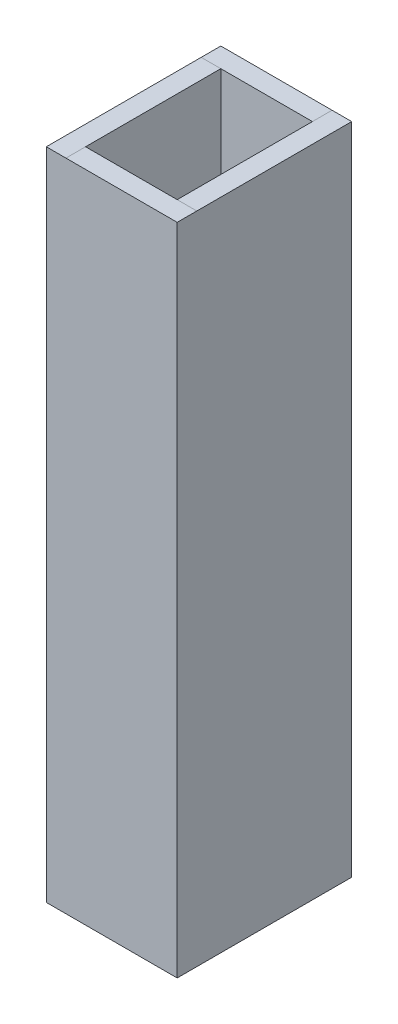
ISO-10303-21;
HEADER;
FILE_DESCRIPTION(('STEP AP214'),'2;1');
FILE_NAME('part.step','',(''),(''),'','','');
FILE_SCHEMA(('AUTOMOTIVE_DESIGN { 1 0 10303 214 1 1 1 1 }'));
ENDSEC;
DATA;
#1=APPLICATION_CONTEXT('core data for automotive mechanical design processes');
#2=APPLICATION_PROTOCOL_DEFINITION('international standard','automotive_design',2000,#1);
#3=PRODUCT_CONTEXT('',#1,'mechanical');
#4=PRODUCT('Part','Part','',(#3));
#5=PRODUCT_RELATED_PRODUCT_CATEGORY('part','',(#4));
#6=PRODUCT_DEFINITION_FORMATION('','',#4);
#7=PRODUCT_DEFINITION_CONTEXT('part definition',#1,'design');
#8=PRODUCT_DEFINITION('design','',#6,#7);
#9=PRODUCT_DEFINITION_SHAPE('','',#8);
#10=(LENGTH_UNIT() NAMED_UNIT(*) SI_UNIT(.MILLI.,.METRE.));
#11=(NAMED_UNIT(*) PLANE_ANGLE_UNIT() SI_UNIT($,.RADIAN.));
#12=(NAMED_UNIT(*) SI_UNIT($,.STERADIAN.) SOLID_ANGLE_UNIT());
#13=UNCERTAINTY_MEASURE_WITH_UNIT(LENGTH_MEASURE(1.E-05),#10,'distance_accuracy_value','');
#14=(GEOMETRIC_REPRESENTATION_CONTEXT(3) GLOBAL_UNCERTAINTY_ASSIGNED_CONTEXT((#13)) GLOBAL_UNIT_ASSIGNED_CONTEXT((#10,
#11,#12)) REPRESENTATION_CONTEXT('',''));
#15=CARTESIAN_POINT('',(0.,0.,0.));
#16=DIRECTION('',(0.,0.,1.));
#17=DIRECTION('',(1.,0.,0.));
#18=AXIS2_PLACEMENT_3D('',#15,#16,#17);
#19=CARTESIAN_POINT('',(0.,381.,0.));
#20=DIRECTION('',(0.,1.,0.));
#21=DIRECTION('',(0.,0.,1.));
#22=AXIS2_PLACEMENT_3D('',#19,#20,#21);
#23=PLANE('',#22);
#24=DIRECTION('',(0.,0.,-1.));
#25=VECTOR('',#24,1.);
#26=CARTESIAN_POINT('',(-11.43,381.,-11.43));
#27=LINE('',#26,#25);
#28=CARTESIAN_POINT('',(-11.43,381.,-11.43));
#29=VERTEX_POINT('',#28);
#30=CARTESIAN_POINT('',(-11.43,381.,-90.17));
#31=VERTEX_POINT('',#30);
#32=EDGE_CURVE('E114',#29,#31,#27,.T.);
#33=ORIENTED_EDGE('',*,*,#32,.F.);
#34=DIRECTION('',(1.,0.,0.));
#35=VECTOR('',#34,1.);
#36=CARTESIAN_POINT('',(0.,381.,-11.43));
#37=LINE('',#36,#35);
#38=CARTESIAN_POINT('',(0.,381.,-11.43));
#39=VERTEX_POINT('',#38);
#40=EDGE_CURVE('E11',#29,#39,#37,.T.);
#41=ORIENTED_EDGE('',*,*,#40,.T.);
#42=DIRECTION('',(0.,0.,-1.));
#43=VECTOR('',#42,1.);
#44=CARTESIAN_POINT('',(0.,381.,0.));
#45=LINE('',#44,#43);
#46=CARTESIAN_POINT('',(0.,381.,-101.6));
#47=VERTEX_POINT('',#46);
#48=EDGE_CURVE('E175',#39,#47,#45,.T.);
#49=ORIENTED_EDGE('',*,*,#48,.T.);
#50=DIRECTION('',(-1.,0.,0.));
#51=VECTOR('',#50,1.);
#52=CARTESIAN_POINT('',(0.,381.,-101.6));
#53=LINE('',#52,#51);
#54=CARTESIAN_POINT('',(-11.43,381.,-101.6));
#55=VERTEX_POINT('',#54);
#56=EDGE_CURVE('E116',#47,#55,#53,.T.);
#57=ORIENTED_EDGE('',*,*,#56,.T.);
#58=DIRECTION('',(0.,0.,1.));
#59=VECTOR('',#58,1.);
#60=CARTESIAN_POINT('',(-11.43,381.,0.));
#61=LINE('',#60,#59);
#62=EDGE_CURVE('E111',#55,#31,#61,.T.);
#63=ORIENTED_EDGE('',*,*,#62,.T.);
#64=EDGE_LOOP('',(#33,#41,#49,#57,#63));
#65=FACE_BOUND('',#64,.T.);
#66=ADVANCED_FACE('F38',(#65),#23,.T.);
#67=ORIENTED_EDGE('',*,*,#40,.F.);
#68=DIRECTION('',(1.,0.,0.));
#69=VECTOR('',#68,1.);
#70=CARTESIAN_POINT('',(-64.77,381.,-11.43));
#71=LINE('',#70,#69);
#72=CARTESIAN_POINT('',(-64.77,381.,-11.43));
#73=VERTEX_POINT('',#72);
#74=EDGE_CURVE('E141',#73,#29,#71,.T.);
#75=ORIENTED_EDGE('',*,*,#74,.F.);
#76=DIRECTION('',(0.,0.,1.));
#77=VECTOR('',#76,1.);
#78=CARTESIAN_POINT('',(-64.77,381.,0.));
#79=LINE('',#78,#77);
#80=CARTESIAN_POINT('',(-64.77,381.,0.));
#81=VERTEX_POINT('',#80);
#82=EDGE_CURVE('E47',#73,#81,#79,.T.);
#83=ORIENTED_EDGE('',*,*,#82,.T.);
#84=DIRECTION('',(1.,0.,0.));
#85=VECTOR('',#84,1.);
#86=CARTESIAN_POINT('',(0.,381.,0.));
#87=LINE('',#86,#85);
#88=CARTESIAN_POINT('',(0.,381.,0.));
#89=VERTEX_POINT('',#88);
#90=EDGE_CURVE('E184',#81,#89,#87,.T.);
#91=ORIENTED_EDGE('',*,*,#90,.T.);
#92=EDGE_CURVE('E176',#89,#39,#45,.T.);
#93=ORIENTED_EDGE('',*,*,#92,.T.);
#94=EDGE_LOOP('',(#67,#75,#83,#91,#93));
#95=FACE_BOUND('',#94,.T.);
#96=ADVANCED_FACE('F231',(#95),#23,.T.);
#97=ORIENTED_EDGE('',*,*,#82,.F.);
#98=DIRECTION('',(0.,0.,1.));
#99=VECTOR('',#98,1.);
#100=CARTESIAN_POINT('',(-64.77,381.,-90.17));
#101=LINE('',#100,#99);
#102=CARTESIAN_POINT('',(-64.77,381.,-90.17));
#103=VERTEX_POINT('',#102);
#104=EDGE_CURVE('E146',#103,#73,#101,.T.);
#105=ORIENTED_EDGE('',*,*,#104,.F.);
#106=DIRECTION('',(-1.,0.,0.));
#107=VECTOR('',#106,1.);
#108=CARTESIAN_POINT('',(0.,381.,-90.17));
#109=LINE('',#108,#107);
#110=CARTESIAN_POINT('',(-76.2,381.,-90.17));
#111=VERTEX_POINT('',#110);
#112=EDGE_CURVE('E121',#103,#111,#109,.T.);
#113=ORIENTED_EDGE('',*,*,#112,.T.);
#114=DIRECTION('',(0.,0.,1.));
#115=VECTOR('',#114,1.);
#116=CARTESIAN_POINT('',(-76.2,381.,0.));
#117=LINE('',#116,#115);
#118=CARTESIAN_POINT('',(-76.2,381.,0.));
#119=VERTEX_POINT('',#118);
#120=EDGE_CURVE('E181',#111,#119,#117,.T.);
#121=ORIENTED_EDGE('',*,*,#120,.T.);
#122=EDGE_CURVE('E185',#119,#81,#87,.T.);
#123=ORIENTED_EDGE('',*,*,#122,.T.);
#124=EDGE_LOOP('',(#97,#105,#113,#121,#123));
#125=FACE_BOUND('',#124,.T.);
#126=ADVANCED_FACE('F211',(#125),#23,.T.);
#127=CARTESIAN_POINT('',(0.,381.,0.));
#128=DIRECTION('',(-1.,0.,0.));
#129=DIRECTION('',(0.,0.,1.));
#130=AXIS2_PLACEMENT_3D('',#127,#128,#129);
#131=PLANE('',#130);
#132=DIRECTION('',(0.,0.,-1.));
#133=VECTOR('',#132,1.);
#134=CARTESIAN_POINT('',(0.,0.,0.));
#135=LINE('',#134,#133);
#136=CARTESIAN_POINT('',(0.,0.,0.));
#137=VERTEX_POINT('',#136);
#138=CARTESIAN_POINT('',(0.,0.,-101.6));
#139=VERTEX_POINT('',#138);
#140=EDGE_CURVE('E164',#137,#139,#135,.T.);
#141=ORIENTED_EDGE('',*,*,#140,.T.);
#142=DIRECTION('',(0.,-1.,0.));
#143=VECTOR('',#142,1.);
#144=CARTESIAN_POINT('',(0.,381.,-101.6));
#145=LINE('',#144,#143);
#146=EDGE_CURVE('E122',#47,#139,#145,.T.);
#147=ORIENTED_EDGE('',*,*,#146,.F.);
#148=ORIENTED_EDGE('',*,*,#48,.F.);
#149=ORIENTED_EDGE('',*,*,#92,.F.);
#150=DIRECTION('',(0.,-1.,0.));
#151=VECTOR('',#150,1.);
#152=CARTESIAN_POINT('',(0.,381.,0.));
#153=LINE('',#152,#151);
#154=EDGE_CURVE('E188',#89,#137,#153,.T.);
#155=ORIENTED_EDGE('',*,*,#154,.T.);
#156=EDGE_LOOP('',(#141,#147,#148,#149,#155));
#157=FACE_BOUND('',#156,.T.);
#158=ADVANCED_FACE('F40',(#157),#131,.F.);
#159=CARTESIAN_POINT('',(0.,381.,-101.6));
#160=DIRECTION('',(0.,0.,1.));
#161=DIRECTION('',(1.,0.,0.));
#162=AXIS2_PLACEMENT_3D('',#159,#160,#161);
#163=PLANE('',#162);
#164=DIRECTION('',(-1.,0.,0.));
#165=VECTOR('',#164,1.);
#166=CARTESIAN_POINT('',(0.,0.,-101.6));
#167=LINE('',#166,#165);
#168=CARTESIAN_POINT('',(-76.2,0.,-101.6));
#169=VERTEX_POINT('',#168);
#170=EDGE_CURVE('E169',#139,#169,#167,.T.);
#171=ORIENTED_EDGE('',*,*,#170,.T.);
#172=DIRECTION('',(0.,-1.,0.));
#173=VECTOR('',#172,1.);
#174=CARTESIAN_POINT('',(-76.2,381.,-101.6));
#175=LINE('',#174,#173);
#176=CARTESIAN_POINT('',(-76.2,381.,-101.6));
#177=VERTEX_POINT('',#176);
#178=EDGE_CURVE('E194',#177,#169,#175,.T.);
#179=ORIENTED_EDGE('',*,*,#178,.F.);
#180=EDGE_CURVE('E179',#55,#177,#53,.T.);
#181=ORIENTED_EDGE('',*,*,#180,.F.);
#182=ORIENTED_EDGE('',*,*,#56,.F.);
#183=ORIENTED_EDGE('',*,*,#146,.T.);
#184=EDGE_LOOP('',(#171,#179,#181,#182,#183));
#185=FACE_BOUND('',#184,.T.);
#186=ADVANCED_FACE('F219',(#185),#163,.F.);
#187=CARTESIAN_POINT('',(-76.2,381.,0.));
#188=DIRECTION('',(1.,0.,0.));
#189=DIRECTION('',(0.,0.,-1.));
#190=AXIS2_PLACEMENT_3D('',#187,#188,#189);
#191=PLANE('',#190);
#192=DIRECTION('',(0.,0.,1.));
#193=VECTOR('',#192,1.);
#194=CARTESIAN_POINT('',(-76.2,0.,0.));
#195=LINE('',#194,#193);
#196=CARTESIAN_POINT('',(-76.2,0.,0.));
#197=VERTEX_POINT('',#196);
#198=EDGE_CURVE('E171',#169,#197,#195,.T.);
#199=ORIENTED_EDGE('',*,*,#198,.T.);
#200=DIRECTION('',(0.,-1.,0.));
#201=VECTOR('',#200,1.);
#202=CARTESIAN_POINT('',(-76.2,381.,0.));
#203=LINE('',#202,#201);
#204=EDGE_CURVE('E191',#119,#197,#203,.T.);
#205=ORIENTED_EDGE('',*,*,#204,.F.);
#206=ORIENTED_EDGE('',*,*,#120,.F.);
#207=EDGE_CURVE('E182',#177,#111,#117,.T.);
#208=ORIENTED_EDGE('',*,*,#207,.F.);
#209=ORIENTED_EDGE('',*,*,#178,.T.);
#210=EDGE_LOOP('',(#199,#205,#206,#208,#209));
#211=FACE_BOUND('',#210,.T.);
#212=ADVANCED_FACE('F215',(#211),#191,.F.);
#213=CARTESIAN_POINT('',(0.,381.,0.));
#214=DIRECTION('',(0.,0.,-1.));
#215=DIRECTION('',(-1.,0.,0.));
#216=AXIS2_PLACEMENT_3D('',#213,#214,#215);
#217=PLANE('',#216);
#218=DIRECTION('',(1.,0.,0.));
#219=VECTOR('',#218,1.);
#220=CARTESIAN_POINT('',(0.,0.,0.));
#221=LINE('',#220,#219);
#222=EDGE_CURVE('E173',#197,#137,#221,.T.);
#223=ORIENTED_EDGE('',*,*,#222,.T.);
#224=ORIENTED_EDGE('',*,*,#154,.F.);
#225=ORIENTED_EDGE('',*,*,#90,.F.);
#226=ORIENTED_EDGE('',*,*,#122,.F.);
#227=ORIENTED_EDGE('',*,*,#204,.T.);
#228=EDGE_LOOP('',(#223,#224,#225,#226,#227));
#229=FACE_BOUND('',#228,.T.);
#230=ADVANCED_FACE('F227',(#229),#217,.F.);
#231=ORIENTED_EDGE('',*,*,#112,.F.);
#232=DIRECTION('',(-1.,0.,0.));
#233=VECTOR('',#232,1.);
#234=CARTESIAN_POINT('',(-11.43,381.,-90.17));
#235=LINE('',#234,#233);
#236=EDGE_CURVE('E129',#31,#103,#235,.T.);
#237=ORIENTED_EDGE('',*,*,#236,.F.);
#238=ORIENTED_EDGE('',*,*,#62,.F.);
#239=ORIENTED_EDGE('',*,*,#180,.T.);
#240=ORIENTED_EDGE('',*,*,#207,.T.);
#241=EDGE_LOOP('',(#231,#237,#238,#239,#240));
#242=FACE_BOUND('',#241,.T.);
#243=ADVANCED_FACE('F143',(#242),#23,.T.);
#244=CARTESIAN_POINT('',(0.,0.,0.));
#245=DIRECTION('',(0.,1.,0.));
#246=DIRECTION('',(0.,0.,1.));
#247=AXIS2_PLACEMENT_3D('',#244,#245,#246);
#248=PLANE('',#247);
#249=ORIENTED_EDGE('',*,*,#140,.F.);
#250=ORIENTED_EDGE('',*,*,#222,.F.);
#251=ORIENTED_EDGE('',*,*,#198,.F.);
#252=ORIENTED_EDGE('',*,*,#170,.F.);
#253=EDGE_LOOP('',(#249,#250,#251,#252));
#254=FACE_BOUND('',#253,.T.);
#255=ADVANCED_FACE('F224',(#254),#248,.F.);
#256=CARTESIAN_POINT('',(-64.77,246.38,-11.43));
#257=DIRECTION('',(0.,0.,1.));
#258=DIRECTION('',(1.,0.,0.));
#259=AXIS2_PLACEMENT_3D('',#256,#257,#258);
#260=PLANE('',#259);
#261=ORIENTED_EDGE('',*,*,#74,.T.);
#262=DIRECTION('',(0.,1.,0.));
#263=VECTOR('',#262,1.);
#264=CARTESIAN_POINT('',(-11.43,246.38,-11.43));
#265=LINE('',#264,#263);
#266=CARTESIAN_POINT('',(-11.43,246.38,-11.43));
#267=VERTEX_POINT('',#266);
#268=EDGE_CURVE('E137',#267,#29,#265,.T.);
#269=ORIENTED_EDGE('',*,*,#268,.F.);
#270=DIRECTION('',(1.,0.,0.));
#271=VECTOR('',#270,1.);
#272=CARTESIAN_POINT('',(-64.77,246.38,-11.43));
#273=LINE('',#272,#271);
#274=CARTESIAN_POINT('',(-64.77,246.38,-11.43));
#275=VERTEX_POINT('',#274);
#276=EDGE_CURVE('E149',#275,#267,#273,.T.);
#277=ORIENTED_EDGE('',*,*,#276,.F.);
#278=DIRECTION('',(0.,1.,0.));
#279=VECTOR('',#278,1.);
#280=CARTESIAN_POINT('',(-64.77,246.38,-11.43));
#281=LINE('',#280,#279);
#282=EDGE_CURVE('E161',#275,#73,#281,.T.);
#283=ORIENTED_EDGE('',*,*,#282,.T.);
#284=EDGE_LOOP('',(#261,#269,#277,#283));
#285=FACE_BOUND('',#284,.T.);
#286=ADVANCED_FACE('F235',(#285),#260,.F.);
#287=CARTESIAN_POINT('',(-64.77,246.38,-90.17));
#288=DIRECTION('',(-1.,0.,0.));
#289=DIRECTION('',(0.,0.,1.));
#290=AXIS2_PLACEMENT_3D('',#287,#288,#289);
#291=PLANE('',#290);
#292=ORIENTED_EDGE('',*,*,#104,.T.);
#293=ORIENTED_EDGE('',*,*,#282,.F.);
#294=DIRECTION('',(0.,0.,1.));
#295=VECTOR('',#294,1.);
#296=CARTESIAN_POINT('',(-64.77,246.38,-90.17));
#297=LINE('',#296,#295);
#298=CARTESIAN_POINT('',(-64.77,246.38,-90.17));
#299=VERTEX_POINT('',#298);
#300=EDGE_CURVE('E158',#299,#275,#297,.T.);
#301=ORIENTED_EDGE('',*,*,#300,.F.);
#302=DIRECTION('',(0.,1.,0.));
#303=VECTOR('',#302,1.);
#304=CARTESIAN_POINT('',(-64.77,246.38,-90.17));
#305=LINE('',#304,#303);
#306=EDGE_CURVE('E136',#299,#103,#305,.T.);
#307=ORIENTED_EDGE('',*,*,#306,.T.);
#308=EDGE_LOOP('',(#292,#293,#301,#307));
#309=FACE_BOUND('',#308,.T.);
#310=ADVANCED_FACE('F238',(#309),#291,.F.);
#311=CARTESIAN_POINT('',(-11.43,246.38,-90.17));
#312=DIRECTION('',(0.,0.,-1.));
#313=DIRECTION('',(-1.,0.,0.));
#314=AXIS2_PLACEMENT_3D('',#311,#312,#313);
#315=PLANE('',#314);
#316=ORIENTED_EDGE('',*,*,#236,.T.);
#317=ORIENTED_EDGE('',*,*,#306,.F.);
#318=DIRECTION('',(-1.,0.,0.));
#319=VECTOR('',#318,1.);
#320=CARTESIAN_POINT('',(-11.43,246.38,-90.17));
#321=LINE('',#320,#319);
#322=CARTESIAN_POINT('',(-11.43,246.38,-90.17));
#323=VERTEX_POINT('',#322);
#324=EDGE_CURVE('E132',#323,#299,#321,.T.);
#325=ORIENTED_EDGE('',*,*,#324,.F.);
#326=DIRECTION('',(0.,1.,0.));
#327=VECTOR('',#326,1.);
#328=CARTESIAN_POINT('',(-11.43,246.38,-90.17));
#329=LINE('',#328,#327);
#330=EDGE_CURVE('E127',#323,#31,#329,.T.);
#331=ORIENTED_EDGE('',*,*,#330,.T.);
#332=EDGE_LOOP('',(#316,#317,#325,#331));
#333=FACE_BOUND('',#332,.T.);
#334=ADVANCED_FACE('F128',(#333),#315,.F.);
#335=CARTESIAN_POINT('',(-11.43,246.38,-11.43));
#336=DIRECTION('',(1.,0.,0.));
#337=DIRECTION('',(0.,0.,-1.));
#338=AXIS2_PLACEMENT_3D('',#335,#336,#337);
#339=PLANE('',#338);
#340=ORIENTED_EDGE('',*,*,#32,.T.);
#341=ORIENTED_EDGE('',*,*,#330,.F.);
#342=DIRECTION('',(0.,0.,-1.));
#343=VECTOR('',#342,1.);
#344=CARTESIAN_POINT('',(-11.43,246.38,-11.43));
#345=LINE('',#344,#343);
#346=EDGE_CURVE('E155',#267,#323,#345,.T.);
#347=ORIENTED_EDGE('',*,*,#346,.F.);
#348=ORIENTED_EDGE('',*,*,#268,.T.);
#349=EDGE_LOOP('',(#340,#341,#347,#348));
#350=FACE_BOUND('',#349,.T.);
#351=ADVANCED_FACE('F140',(#350),#339,.F.);
#352=CARTESIAN_POINT('',(-11.43,246.38,-11.43));
#353=DIRECTION('',(0.,1.,0.));
#354=DIRECTION('',(0.,0.,1.));
#355=AXIS2_PLACEMENT_3D('',#352,#353,#354);
#356=PLANE('',#355);
#357=ORIENTED_EDGE('',*,*,#276,.T.);
#358=ORIENTED_EDGE('',*,*,#346,.T.);
#359=ORIENTED_EDGE('',*,*,#324,.T.);
#360=ORIENTED_EDGE('',*,*,#300,.T.);
#361=EDGE_LOOP('',(#357,#358,#359,#360));
#362=FACE_BOUND('',#361,.T.);
#363=ADVANCED_FACE('F240',(#362),#356,.T.);
#364=CLOSED_SHELL('',(#66,#96,#126,#158,#186,#212,#230,#243,#255,#286,#310,#334,#351,#363));
#365=MANIFOLD_SOLID_BREP('B2',#364);
#366=ADVANCED_BREP_SHAPE_REPRESENTATION('',(#18,#365),#14);
#367=SHAPE_DEFINITION_REPRESENTATION(#9,#366);
ENDSEC;
END-ISO-10303-21;
